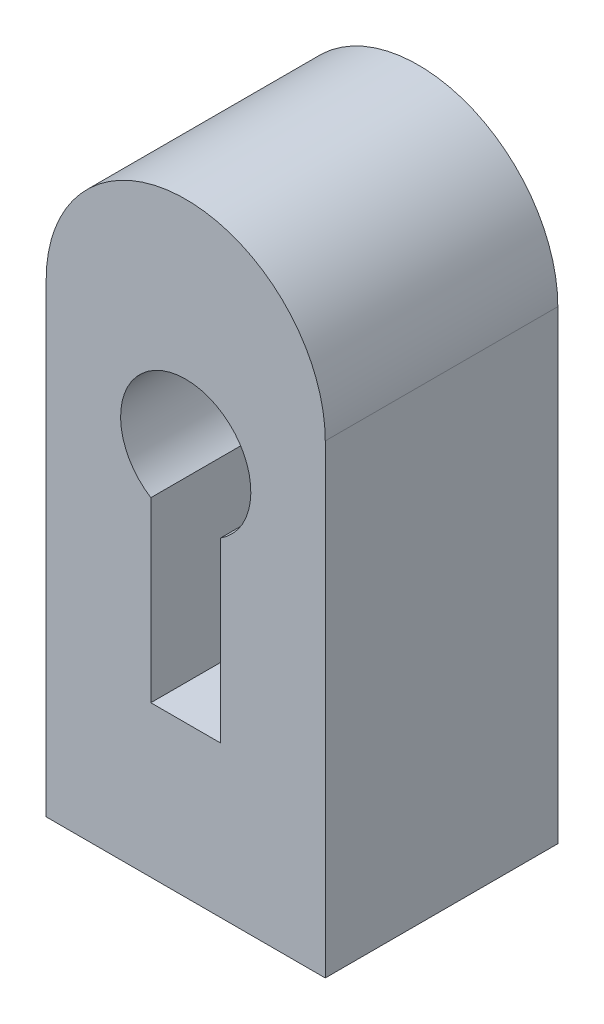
from build123d import *

# Parameters (mm, degrees)
EXTRUDE1_DEPTH     = 63.5
CUT_EXTRUDE1_DEPTH = 252.44717139


with BuildPart() as part:
    # Sketch1 → Extrude1 (new, symmetric)
    with BuildSketch(Plane.XY):
        with BuildLine():
            Line((-76.2, 127), (-76.2, -127))
            Line((-76.2, -127), (76.2, -127))
            Line((76.2, -127), (76.2, 127))
            ThreePointArc((76.2, 127), (0, 203.2), (-76.2, 127))
        make_face()
    extrude(amount=EXTRUDE1_DEPTH, both=True)

    # Sketch2 → Cut-Extrude1 (cut, through all)
    with BuildSketch(Plane.XY.offset(63.5)):
        with BuildLine():
            Line((19.05, 52.523160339), (19.05, -44.45))
            Line((19.05, -44.45), (-19.05, -44.45))
            Line((-19.05, -44.45), (-19.05, 52.523160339))
            ThreePointArc((-19.05, 52.523160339), (0, 118.11), (19.05, 52.523160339))
        make_face()
    extrude(amount=-CUT_EXTRUDE1_DEPTH, mode=Mode.SUBTRACT)


solid = part.part
